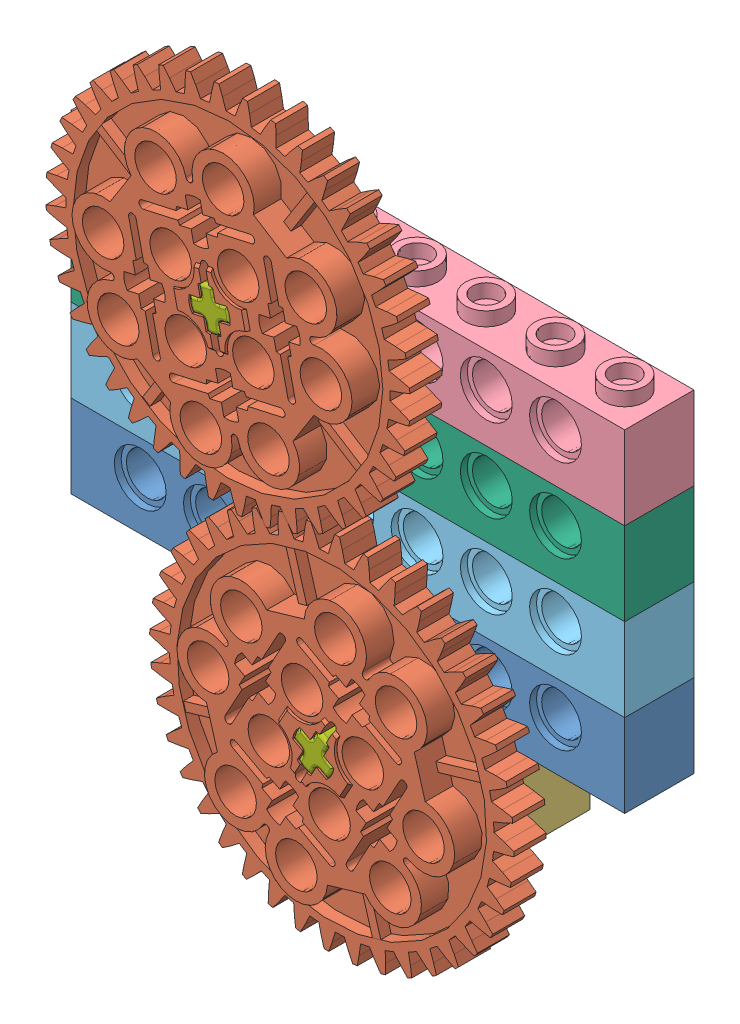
SolidWorks assembly Assem1.sldasm, configuration Default (file format 12000). Lengths in mm.
Overall size (65.71 92.11 16).
9 component instances, 7 part files, 25 mates.
Components (placement in the parent):
- 3702 Brick 1 x 8 with Holes-1: 3702 Brick 1 x 8 with Holes.SLDPRT [Default] at (30.0551 24.7999 47.9093) size (64 11.2 8)
- 3649 Gear 40 _-1: 3649 Gear 40 _.SLDPRT [Default] at (22.0551 59.1999 55.9093) x (-0.975896 -0.218235 0) z (-0.218235 0.975896 0) size (42.1 8 42.1)
- 3701 Brick 1 x 4 with Holes Green-1: 3701 Brick 1 x 4 with Holes Green.SLDPRT [Default] at (34.0551 19.9999 47.9093) size (32 11.2 8)
- 3702 Brick 1 x 8 with Holes Blue-1: 3702 Brick 1 x 8 with Holes Blue.SLDPRT [Default] at (30.0551 53.5999 47.9093) size (64 11.2 8)
- 3702 Brick 1 x 8 with Holes Gray-1: 3702 Brick 1 x 8 with Holes Gray.SLDPRT [Default] at (30.0551 34.3999 47.9093) size (64 11.2 8)
- 3702 Brick 1 x 8 with Holes Yellow-1: 3702 Brick 1 x 8 with Holes Yellow.SLDPRT [Default] at (30.0551 43.9999 47.9093) size (64 11.2 8)
- 3749 Axle Pin without Friction Ridges Lengthwise-1: 3749 Axle Pin without Friction Ridges Lengthwise.SLDPRT [Default] at (22.0551 59.1999 51.9093) x (0.218235 -0.975896 0) z (-0.975896 -0.218235 0) size (6 16 6)
- 3749 Axle Pin without Friction Ridges Lengthwise-2: 3749 Axle Pin without Friction Ridges Lengthwise.SLDPRT [Default] at (34.0551 20.7999 51.9093) x (0.877255 -0.480025 0) z (-0.480025 -0.877255 0) size (6 16 6)
- 3649 Gear 40 _-2: 3649 Gear 40 _.SLDPRT [Default] at (34.0551 20.7999 55.9093) x (0.877255 -0.480025 0) z (-0.480025 -0.877255 0) size (42.1 8 42.1)
Mates (geometry in assembly coordinates):
- Tangent1: tangent anti-aligned: cylinder of 3702 Brick 1 x 8 with Holes-1 through (2.0551 35.9999 47.9093) axis (0 -1 0) radius 2.4; plane of 3702 Brick 1 x 8 with Holes Gray-1 through (-1.9449 43.9999 45.5093) normal (0 0 1)
- Tangent2: tangent anti-aligned: cylinder of 3702 Brick 1 x 8 with Holes-1 through (58.0551 35.9999 47.9093) axis (0 -1 0) radius 2.4; plane of 3702 Brick 1 x 8 with Holes Gray-1 through (-1.9449 43.9999 45.5093) normal (0 0 1)
- Coincident1: coincident anti-aligned: plane of 3702 Brick 1 x 8 with Holes-1 through (30.0551 34.3999 47.9093) normal (0 1 0); plane of 3702 Brick 1 x 8 with Holes Gray-1 through (30.0551 34.3999 47.9093) normal (0 -1 0)
- Coincident2: coincident aligned: plane of 3702 Brick 1 x 8 with Holes-1 through (62.0551 34.3999 51.9093) normal (1 0 0); plane of 3702 Brick 1 x 8 with Holes Gray-1 through (62.0551 43.9999 51.9093) normal (1 0 0)
- Tangent7: tangent anti-aligned: cylinder of 3702 Brick 1 x 8 with Holes Gray-1 through (2.0551 45.5999 47.9093) axis (0 -1 0) radius 2.4; plane of 3702 Brick 1 x 8 with Holes Yellow-1 through (-1.9449 53.5999 45.5093) normal (0 0 1)
- Tangent8: tangent anti-aligned: cylinder of 3702 Brick 1 x 8 with Holes Gray-1 through (58.0551 45.5999 47.9093) axis (0 -1 0) radius 2.4; plane of 3702 Brick 1 x 8 with Holes Yellow-1 through (-1.9449 53.5999 45.5093) normal (0 0 1)
- Coincident7: coincident anti-aligned: plane of 3702 Brick 1 x 8 with Holes Gray-1 through (30.0551 43.9999 47.9093) normal (0 1 0); plane of 3702 Brick 1 x 8 with Holes Yellow-1 through (30.0551 43.9999 47.9093) normal (0 -1 0)
- Coincident8: coincident aligned: plane of 3702 Brick 1 x 8 with Holes-1 through (-1.9449 34.3999 51.9093) normal (-1 0 0); plane of 3702 Brick 1 x 8 with Holes Yellow-1 through (-1.9449 53.5999 51.9093) normal (-1 0 0)
- Tangent9: tangent anti-aligned: plane of 3702 Brick 1 x 8 with Holes Blue-1 through (-1.9449 63.1999 45.5093) normal (0 0 1); cylinder of 3702 Brick 1 x 8 with Holes Yellow-1 through (58.0551 55.1999 47.9093) axis (0 -1 0) radius 2.4
- Tangent10: tangent anti-aligned: plane of 3702 Brick 1 x 8 with Holes Blue-1 through (-1.9449 63.1999 45.5093) normal (0 0 1); cylinder of 3702 Brick 1 x 8 with Holes Yellow-1 through (2.0551 55.1999 47.9093) axis (0 -1 0) radius 2.4
- Coincident9: coincident anti-aligned: plane of 3702 Brick 1 x 8 with Holes Blue-1 through (30.0551 53.5999 47.9093) normal (0 -1 0); plane of 3702 Brick 1 x 8 with Holes Yellow-1 through (30.0551 53.5999 47.9093) normal (0 1 0)
- Coincident10: coincident aligned: plane of 3702 Brick 1 x 8 with Holes-1 through (-1.9449 34.3999 51.9093) normal (-1 0 0); plane of 3702 Brick 1 x 8 with Holes Blue-1 through (-1.9449 63.1999 51.9093) normal (-1 0 0)
- Concentric1: concentric aligned: cylinder of 3702 Brick 1 x 8 with Holes Blue-1 through (22.0551 59.1999 43.9093) axis (0 0 1) radius 2.4; cylinder of 3749 Axle Pin without Friction Ridges Lengthwise-1 through (22.0551 59.1999 43.9093) axis (0 0 1) radius 2.4
- Coincident11: coincident anti-aligned: plane of 3702 Brick 1 x 8 with Holes Blue-1 through (22.0551 59.1999 51.1093) normal (0 0 1); plane of 3749 Axle Pin without Friction Ridges Lengthwise-1 through (22.0551 59.1999 51.1093) normal (0 0 -1)
- Concentric2: concentric anti-aligned: cylinder of 3649 Gear 40 _-1 through (22.0551 59.1999 51.9093) axis (0 0 1) radius 2.4; cylinder of 3749 Axle Pin without Friction Ridges Lengthwise-1 through (22.0551 59.1999 59.9093) axis (0 0 -1) radius 2.4
- Coincident12: coincident anti-aligned: plane of 3649 Gear 40 _-1 through (22.7219 60.2508 51.9093) normal (0.218235 -0.975896 0); plane of 3749 Axle Pin without Friction Ridges Lengthwise-1 through (24.0421 60.546 59.9093) normal (-0.218235 0.975896 0)
- Coincident13: coincident anti-aligned: plane of 3649 Gear 40 _-1 through (25.0858 63.9765 51.9093) normal (0 0 -1); plane of 3702 Brick 1 x 8 with Holes Blue-1 through (-1.9449 63.1999 51.9093) normal (0 0 1)
- Coincident17: coincident aligned: plane of 3702 Brick 1 x 8 with Holes-1 through (-1.9449 34.3999 43.9093) normal (0 0 -1); plane of 3701 Brick 1 x 4 with Holes Green-1 through (34.0551 19.9999 43.9093) normal (0 0 -1)
- Coincident18: coincident anti-aligned: plane of 3702 Brick 1 x 8 with Holes-1 through (30.0551 24.7999 47.9093) normal (0 -1 0); plane of 3701 Brick 1 x 4 with Holes Green-1 through (18.0551 24.7999 43.9093) normal (0 1 0)
- Concentric4: concentric aligned: cylinder of 3701 Brick 1 x 4 with Holes Green-1 through (34.0551 20.7999 43.9093) axis (0 0 1) radius 2.4; cylinder of 3749 Axle Pin without Friction Ridges Lengthwise-2 through (34.0551 20.7999 43.9093) axis (0 0 1) radius 2.4
- Coincident19: coincident anti-aligned: plane of 3701 Brick 1 x 4 with Holes Green-1 through (34.0551 20.7999 51.1093) normal (0 0 1); plane of 3749 Axle Pin without Friction Ridges Lengthwise-2 through (34.0551 20.7999 51.1093) normal (0 0 -1)
- Concentric5: concentric anti-aligned: cylinder of 3749 Axle Pin without Friction Ridges Lengthwise-2 through (34.0551 20.7999 59.9093) axis (0 0 -1) radius 2.4; cylinder of 3649 Gear 40 _-2 through (34.0551 20.7999 51.9093) axis (0 0 1) radius 2.4
- Coincident20: coincident anti-aligned: plane of 3749 Axle Pin without Friction Ridges Lengthwise-2 through (31.6739 21.0998 59.9093) normal (-0.480025 -0.877255 0); plane of 3649 Gear 40 _-2 through (32.8607 20.4504 51.9093) normal (0.480025 0.877255 0)
- Coincident21: coincident anti-aligned: plane of 3701 Brick 1 x 4 with Holes Green-1 through (34.0551 19.9999 51.9093) normal (0 0 1); plane of 3649 Gear 40 _-2 through (28.626 19.211 51.9093) normal (0 0 -1)
- Concentric6: concentric aligned: cylinder of 3702 Brick 1 x 8 with Holes-1 through (22.0551 36.0019 47.9093) axis (0 -1 0) radius 1.6; cylinder of 3701 Brick 1 x 4 with Holes Green-1 through (22.0551 26.3999 47.9093) axis (0 -1 0) radius 1.6
